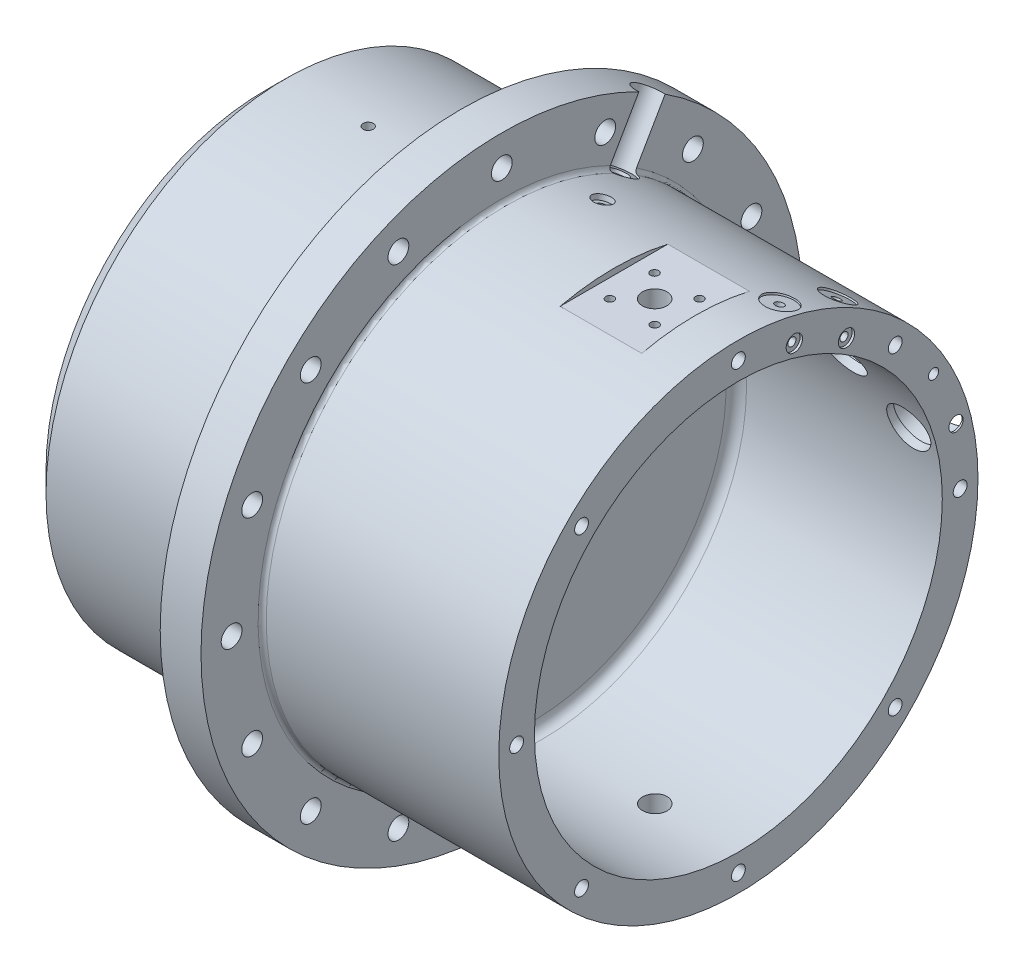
from build123d import *

# Parameters (mm, degrees)
FASE1_SIZE                            = 2
KREISMUSTER1_COUNT                    = 8
FASE2_SIZE                            = 10
SKIZZE4_W                             = 100
SKIZZE4_H                             = 40
SCHNITT_LINEAR_AUSTRAGEN1_DEPTH       = 3
M5_GEWINDEBOHRUNG1_AT_2_COUNT         = 2
M5_GEWINDEBOHRUNG1_AT_2_PITCH         = 22
M5_GEWINDEBOHRUNG1_AT_3_COUNT         = 2
M5_GEWINDEBOHRUNG1_AT_3_PITCH         = 31.08799153
M5_GEWINDEBOHRUNG1_AT_4_COUNT         = 2
M5_GEWINDEBOHRUNG1_AT_4_PITCH         = 22
F_12_0_12_DURCHMESSER_BOHRUNG1_REACH  = 358.217
F_12_0_12_DURCHMESSER_BOHRUNG1_BORE_R = 6
M12_GEWINDEKERNLOCH1_D                = 10.2
KREISMUSTER2_COUNT                    = 16
F_4_0_4_DURCHMESSER_BOHRUNG1_D        = 4
F_4_0_4_DURCHMESSER_BOHRUNG1_DEPTH    = 100
F_4_0_4_DURCHMESSER_BOHRUNG1_TIP      = 1.201721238
F_4_0_4_DURCHMESSER_BOHRUNG2_D        = 4
F_4_0_4_DURCHMESSER_BOHRUNG2_DEPTH    = 120
F_4_0_4_DURCHMESSER_BOHRUNG2_TIP      = 1.201721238
SKIZZE16_R                            = 4
SCHNITT_LINEAR_AUSTRAGEN3_DEPTH       = 1.2
SKIZZE17_R                            = 4.5
SCHNITT_LINEAR_AUSTRAGEN4_DEPTH       = 2.5
SKIZZE18_R                            = 4.5
SCHNITT_LINEAR_AUSTRAGEN5_DEPTH       = 2.5
SCHNITT_LINEAR_AUSTRAGEN11_DEPTH      = 359.762791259
SCHNITT_LINEAR_AUSTRAGEN11_DEPTH_BACK = 1
SKIZZE23_R                            = 7.5
M5_GEWINDEKERNLOCH3_D                 = 4.2
M5_GEWINDEKERNLOCH3_DEPTH             = 20
M5_GEWINDEKERNLOCH3_TIP               = 1.2618073
M5_GEWINDEKERNLOCH5_D                 = 4.2
M5_GEWINDEKERNLOCH5_DEPTH             = 22
M5_GEWINDEKERNLOCH5_TIP               = 1.2618073
SKIZZE27_R                            = 12.5
SCHNITT_LINEAR_AUSTRAGEN6_DEPTH       = 14
SCHNITT_LINEAR_AUSTRAGEN7_REACH       = 348.374
SCHNITT_LINEAR_AUSTRAGEN7_END_RADIUS  = 100
SKIZZE28_R                            = 10.5
M6_GEWINDEKERNLOCH1_REACH             = 394.525
M6_GEWINDEKERNLOCH1_BORE_R            = 2.5
SCHNITT_LINEAR_AUSTRAGEN8_REACH       = 355.445
SCHNITT_LINEAR_AUSTRAGEN8_END_RADIUS  = 100
SKIZZE32_R                            = 2.5
SCHNITT_LINEAR_AUSTRAGEN9_REACH       = 363.105
SCHNITT_LINEAR_AUSTRAGEN9_END_RADIUS  = 100
SKIZZE33_R                            = 10.5
SKIZZE34_R                            = 12.5
SCHNITT_LINEAR_AUSTRAGEN10_DEPTH      = 14
F_7_0_7_DURCHMESSER_BOHRUNG2_REACH    = 388.614
F_7_0_7_DURCHMESSER_BOHRUNG2_BORE_R   = 3.5
SKIZZE41_R                            = 7.5
SCHNITT_LINEAR_AUSTRAGEN12_DEPTH      = 1
SKIZZE42_R                            = 7.5
SCHNITT_LINEAR_AUSTRAGEN13_DEPTH      = 1
M5_GEWINDEKERNLOCH6_D                 = 4.2
M5_GEWINDEKERNLOCH6_DEPTH             = 12
M5_GEWINDEKERNLOCH6_TIP               = 1.2618073
M5_GEWINDEKERNLOCH6_ON_FACE_2_D       = 4.2
M5_GEWINDEKERNLOCH6_ON_FACE_2_DEPTH   = 12
M5_GEWINDEKERNLOCH6_ON_FACE_2_TIP     = 1.2618073


with BuildPart() as part:
    # Skizze1 → Rotation1 (revolve)
    with BuildSketch(Plane.XY, mode=Mode.PRIVATE) as rotation1_sk:
        with BuildLine():
            Line((-76.944736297, 117.5), (14.055263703, 117.5))
            ThreePointArc((14.055263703, 117.5), (17.590797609, 118.964466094), (19.055263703, 122.5))
            Line((19.055263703, 122.5), (19.055263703, 147.5))
            Line((19.055263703, 147.5), (39.055263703, 147.5))
            Line((39.055263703, 147.5), (39.055263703, 119.5))
            ThreePointArc((39.055263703, 119.5), (39.64105014, 118.085786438), (41.055263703, 117.5))
            Line((41.055263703, 117.5), (155.055263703, 117.5))
            Line((155.055263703, 117.5), (155.055263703, 100))
            Line((155.055263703, 100), (59.055263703, 100))
            ThreePointArc((59.055263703, 100), (55.519729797, 98.535533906), (54.055263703, 95))
            Line((54.055263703, 95), (54.055263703, 40.5))
            Line((54.055263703, 40.5), (49.555263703, 40.5))
            Line((49.555263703, 40.5), (49.555263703, 44.902710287))
            Line((49.555263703, 44.902710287), (43.555263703, 44.902710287))
            Line((43.555263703, 44.902710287), (43.555263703, 40.5))
            Line((43.555263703, 40.5), (39.055263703, 40.5))
            Line((39.055263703, 40.5), (39.055263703, 95))
            ThreePointArc((39.055263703, 95), (37.590797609, 98.535533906), (34.055263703, 100))
            Line((34.055263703, 100), (-76.944736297, 100))
            Line((-76.944736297, 100), (-76.944736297, 117.5))
        make_face()
    revolve(rotation1_sk.sketch.rotate(Axis((0, 0, 0), (1, 0, 0)), 90), axis=Axis((0, 0, 0), (1, 0, 0)))

    # Fase1
    fase1_edges = [part.edges().sort_by_distance(p)[0] for p in [
        (54.055263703, 0, -40.5),
        (39.055263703, 0, -40.5),
    ]]
    chamfer(fase1_edges, length=FASE1_SIZE)

    # Skizze3 → M8 Gewindekernloch1 (revolve, cut)
    with BuildSketch(Plane(origin=(155.055263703, 108.75, 0), x_dir=(0, 0, -1), z_dir=(0, 1, 0))):
        Polygon((0, 0), (0, 24.292926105), (3.4, 22.25), (3.4, 0), align=None)
    m8_gewindekernloch1 = revolve(axis=Axis((161.405263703, 108.75, 0), (-1, 0, 0)), mode=Mode.SUBTRACT)

    # Kreismuster1: M8 Gewindekernloch1 ×8 about axis
    kreismuster1_axis = Axis((0, 0, 0), (1, 0, 0))
    for i in range(1, KREISMUSTER1_COUNT):
        add(m8_gewindekernloch1.rotate(kreismuster1_axis, i * 360 / KREISMUSTER1_COUNT), mode=Mode.SUBTRACT)

    # Fase2
    fase2_edges = [part.edges().sort_by_distance(p)[0] for p in [
        (-76.944736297, 0, -117.5),
    ]]
    chamfer(fase2_edges, length=FASE2_SIZE)

    # Skizze4 → Schnitt-Linear austragen1 (cut)
    with BuildSketch(Plane(origin=(-26.444736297, 117.5, 0), x_dir=(0, 0, -1), z_dir=(0, 1, 0))):
        with Locations((0, -140.5)):
            Rectangle(SKIZZE4_W, SKIZZE4_H)
    schnitt_linear_austragen1 = extrude(amount=-SCHNITT_LINEAR_AUSTRAGEN1_DEPTH, mode=Mode.SUBTRACT)

    # Spiegeln1: Schnitt-Linear austragen1 across plane
    add(schnitt_linear_austragen1.mirror(Plane.ZX), mode=Mode.SUBTRACT)

    # Skizze7 → M5 Gewindebohrung1 (revolve, cut)
    with BuildSketch(Plane(origin=(125.020336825, 114.5, -10.985670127), x_dir=(0, 0, 1), z_dir=(1, 0, 0))):
        Polygon((0, 0), (0, 13.201721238), (2, 12), (2, 0), align=None)
    m5_gewindebohrung1 = revolve(axis=Axis((125.020336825, 120.85, -10.985670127), (0, -1, 0)), mode=Mode.SUBTRACT)

    # M5 Gewindebohrung1 at 2: M5 Gewindebohrung1 ×2
    with Locations(*[Vector(0.0015875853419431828, 0, 0.9999987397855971) * (i * M5_GEWINDEBOHRUNG1_AT_2_PITCH) for i in range(1, M5_GEWINDEBOHRUNG1_AT_2_COUNT)]):
        add(m5_gewindebohrung1, mode=Mode.SUBTRACT)

    # M5 Gewindebohrung1 at 3: M5 Gewindebohrung1 ×2
    with Locations(*[Vector(-0.7065452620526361, 0, 0.7076678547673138) * (i * M5_GEWINDEBOHRUNG1_AT_3_PITCH) for i in range(1, M5_GEWINDEBOHRUNG1_AT_3_COUNT)]):
        add(m5_gewindebohrung1, mode=Mode.SUBTRACT)

    # M5 Gewindebohrung1 at 4: M5 Gewindebohrung1 ×2
    with Locations(*[Vector(-0.9999949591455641, 0, 0.0031751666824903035) * (i * M5_GEWINDEBOHRUNG1_AT_4_PITCH) for i in range(1, M5_GEWINDEBOHRUNG1_AT_4_COUNT)]):
        add(m5_gewindebohrung1, mode=Mode.SUBTRACT)

    # 12.0 _12 _ Durchmesser Bohrung1 bore (on position points) → 12.0 _12 _ Durchmesser Bohrung1 (cut, up to next)
    with BuildSketch(Plane(origin=(114.055263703, 114.5, 0.031751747), x_dir=(0, 0, 1), z_dir=(0, 1, 0)), mode=Mode.PRIVATE) as f_12_0_12_durchmesser_bohrung1_sk1:
        Circle(F_12_0_12_DURCHMESSER_BOHRUNG1_BORE_R)
    f_12_0_12_durchmesser_bohrung1_tool1 = extrude(f_12_0_12_durchmesser_bohrung1_sk1.sketch, amount=-F_12_0_12_DURCHMESSER_BOHRUNG1_REACH, mode=Mode.PRIVATE) & part.part
    f_12_0_12_durchmesser_bohrung1 = f_12_0_12_durchmesser_bohrung1_tool1.solids().sort_by_distance((114.055264, 114.5, 0.031752))[0]
    add(f_12_0_12_durchmesser_bohrung1, mode=Mode.SUBTRACT)

    # Spiegeln2: M5 Gewindebohrung1, 12.0 _12 _ Durchmesser Bohrung1 across plane
    add(m5_gewindebohrung1.mirror(Plane.ZX), mode=Mode.SUBTRACT)
    add(f_12_0_12_durchmesser_bohrung1.mirror(Plane.ZX), mode=Mode.SUBTRACT)

    # Spiegeln2 copy 1 sketch → Spiegeln2 copy 1 (revolve, cut)
    with BuildSketch(Plane(origin=(125.055263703, -114.5, 11.014302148), x_dir=(0, 0, 1), z_dir=(1, 0, 0))):
        Polygon((0, 0), (0, -13.201721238), (2, -12), (2, 0), align=None)
    revolve(axis=Axis((125.055263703, -120.85, 11.014302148), (0, -1, 0)), mode=Mode.SUBTRACT)

    # Spiegeln2 copy 2 sketch → Spiegeln2 copy 2 (revolve, cut)
    with BuildSketch(Plane(origin=(103.055263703, -114.5, 11.014302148), x_dir=(0, 0, 1), z_dir=(1, 0, 0))):
        Polygon((0, 0), (0, -13.201721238), (2, -12), (2, 0), align=None)
    revolve(axis=Axis((103.055263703, -120.85, 11.014302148), (0, -1, 0)), mode=Mode.SUBTRACT)

    # Spiegeln2 copy 3 sketch → Spiegeln2 copy 3 (revolve, cut)
    with BuildSketch(Plane(origin=(103.020447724, -114.5, -10.91581646), x_dir=(0, 0, 1), z_dir=(1, 0, 0))):
        Polygon((0, 0), (0, -13.201721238), (2, -12), (2, 0), align=None)
    revolve(axis=Axis((103.020447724, -120.85, -10.91581646), (0, -1, 0)), mode=Mode.SUBTRACT)

    # M12 Gewindekernloch1 (through all)
    with Locations(Plane(origin=(39.055263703, 132.5, 0), x_dir=(0, 0, 1), z_dir=(1, 0, 0))):
        with Locations((0, 0)):
            m12_gewindekernloch1 = Hole(M12_GEWINDEKERNLOCH1_D / 2)

    # Kreismuster2: M12 Gewindekernloch1 ×16 about axis
    kreismuster2_axis = Axis((0, 0, 0), (1, 0, 0))
    for i in range(1, KREISMUSTER2_COUNT):
        add(m12_gewindekernloch1.rotate(kreismuster2_axis, i * 360 / KREISMUSTER2_COUNT), mode=Mode.SUBTRACT)

    # 4.0 _4 _ Durchmesser Bohrung1
    with Locations(Plane(origin=(155.055263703, 102.388137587, -27.434818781), x_dir=(0, 0, 1), z_dir=(1, 0, 0))):
        with Locations((0, 0)):
            Hole(F_4_0_4_DURCHMESSER_BOHRUNG1_D / 2, depth=F_4_0_4_DURCHMESSER_BOHRUNG1_DEPTH)
            with Locations((0, 0, -(F_4_0_4_DURCHMESSER_BOHRUNG1_DEPTH + F_4_0_4_DURCHMESSER_BOHRUNG1_TIP / 2))):  # 118° drill point
                Cone(0, F_4_0_4_DURCHMESSER_BOHRUNG1_D / 2, F_4_0_4_DURCHMESSER_BOHRUNG1_TIP, mode=Mode.SUBTRACT)

    # 4.0 _4 _ Durchmesser Bohrung2
    with Locations(Plane(origin=(155.055263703, 91.798692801, -53), x_dir=(0, 0, 1), z_dir=(1, 0, 0))):
        with Locations((0, 0)):
            Hole(F_4_0_4_DURCHMESSER_BOHRUNG2_D / 2, depth=F_4_0_4_DURCHMESSER_BOHRUNG2_DEPTH)
            with Locations((0, 0, -(F_4_0_4_DURCHMESSER_BOHRUNG2_DEPTH + F_4_0_4_DURCHMESSER_BOHRUNG2_TIP / 2))):  # 118° drill point
                Cone(0, F_4_0_4_DURCHMESSER_BOHRUNG2_D / 2, F_4_0_4_DURCHMESSER_BOHRUNG2_TIP, mode=Mode.SUBTRACT)

    # Skizze16 → Schnitt-Linear austragen3 (cut)
    with BuildSketch(Plane(origin=(155.055263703, 0, 0), x_dir=(0, 0, -1), z_dir=(1, 0, 0))):
        with Locations((27.434818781, 102.388137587)):
            Circle(SKIZZE16_R)
        with Locations((53, 91.798692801)):
            Circle(SKIZZE16_R)
    extrude(amount=-SCHNITT_LINEAR_AUSTRAGEN3_DEPTH, mode=Mode.SUBTRACT)

    # Skizze17 → Schnitt-Linear austragen4 (cut)
    with BuildSketch(Plane(origin=(98.055263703, 113.496284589, -30.4112378), x_dir=(0, -0.25881904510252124, -0.9659258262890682), z_dir=(0, 0.9659258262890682, -0.25881904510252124))):
        with Locations(Location((0, 40, 0), (0, 0, 180))):
            Circle(SKIZZE17_R)
    extrude(amount=-SCHNITT_LINEAR_AUSTRAGEN4_DEPTH, mode=Mode.SUBTRACT)

    # Skizze18 → Schnitt-Linear austragen5 (cut)
    with BuildSketch(Plane(origin=(98.055263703, 101.757984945, -58.75), x_dir=(0, -0.500000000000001, -0.866025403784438), z_dir=(0, 0.866025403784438, -0.500000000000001))):
        with Locations(Location((0, 60, 0), (0, 0, 180))):
            Circle(SKIZZE18_R)
    extrude(amount=-SCHNITT_LINEAR_AUSTRAGEN5_DEPTH, mode=Mode.SUBTRACT)

    # Skizze23 → Schnitt-Linear austragen11 (cut, two sides: drawn at the far end of the back side and taken through both)
    with BuildSketch(Plane(origin=(0, 101.757984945, -58.75), x_dir=(-1, 0, 0), z_dir=(0, 0.866025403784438, -0.500000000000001)).offset(-SCHNITT_LINEAR_AUSTRAGEN11_DEPTH_BACK)):
        with Locations(Location((-38.055263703, 0, 0), (0, 0, 262.337744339))):
            Circle(SKIZZE23_R)
    extrude(amount=SCHNITT_LINEAR_AUSTRAGEN11_DEPTH + SCHNITT_LINEAR_AUSTRAGEN11_DEPTH_BACK, mode=Mode.SUBTRACT)

    # M5 Gewindekernloch3
    with Locations(Plane(origin=(38.055263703, 100.891959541, -58.25), x_dir=(0, 0.5, 0.866025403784), z_dir=(0, 0.866025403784, -0.5))):
        with Locations((0, 0)):
            Hole(M5_GEWINDEKERNLOCH3_D / 2, depth=M5_GEWINDEKERNLOCH3_DEPTH)
            with Locations((0, 0, -(M5_GEWINDEKERNLOCH3_DEPTH + M5_GEWINDEKERNLOCH3_TIP / 2))):  # 118° drill point
                Cone(0, M5_GEWINDEKERNLOCH3_D / 2, M5_GEWINDEKERNLOCH3_TIP, mode=Mode.SUBTRACT)

    # M5 Gewindekernloch5
    with Locations(Plane(origin=(58.055263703, 111.081470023, -29.764190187), x_dir=(0, 0.258819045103, 0.965925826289), z_dir=(0, 0.965925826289, -0.258819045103))):
        with Locations((0, 0)):
            Hole(M5_GEWINDEKERNLOCH5_D / 2, depth=M5_GEWINDEKERNLOCH5_DEPTH)
            with Locations((0, 0, -(M5_GEWINDEKERNLOCH5_DEPTH + M5_GEWINDEKERNLOCH5_TIP / 2))):  # 118° drill point
                Cone(0, M5_GEWINDEKERNLOCH5_D / 2, M5_GEWINDEKERNLOCH5_TIP, mode=Mode.SUBTRACT)

    # Skizze27 → Schnitt-Linear austragen6 (cut)
    with BuildSketch(Plane(origin=(98.055263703, 58.75, -101.757984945), x_dir=(0, -0.8660254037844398, -0.49999999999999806), z_dir=(0, 0.49999999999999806, -0.8660254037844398))):
        with Locations(Location((0, -22, 0), (0, 0, 180))):
            Circle(SKIZZE27_R)
    extrude(amount=-SCHNITT_LINEAR_AUSTRAGEN6_DEPTH, mode=Mode.SUBTRACT)

    # Schnitt-Linear austragen7: up to this cylinder (the profile starts outside it)
    schnitt_linear_austragen7_end = Plane(origin=(120.055264, 0, 0), z_dir=(-1, 0, 0)) * Cylinder(SCHNITT_LINEAR_AUSTRAGEN7_END_RADIUS, 897.748, mode=Mode.PRIVATE)
    # Skizze28 → Schnitt-Linear austragen7 (cut, up to the surface)
    with BuildSketch(Plane(origin=(0, 51.75, -89.633629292), x_dir=(-1, 0, 0), z_dir=(0, 0.49999999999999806, -0.8660254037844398)), mode=Mode.PRIVATE) as schnitt_linear_austragen7_sk1:
        with Locations(Location((-120.055263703, 0, 0), (0, 0, 90))):
            Circle(SKIZZE28_R)
    schnitt_linear_austragen7_tool1 = extrude(schnitt_linear_austragen7_sk1.sketch, amount=-SCHNITT_LINEAR_AUSTRAGEN7_REACH, mode=Mode.PRIVATE) - schnitt_linear_austragen7_end
    add(schnitt_linear_austragen7_tool1.solids().sort_by_distance((120.055264, 51.75, -89.633629))[0], mode=Mode.SUBTRACT)

    # M6 Gewindekernloch1 bore (on position points) → M6 Gewindekernloch1 (cut, up to next)
    with BuildSketch(Plane(origin=(155.055263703, 55.25, -95.695807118), x_dir=(0, 0, 1), z_dir=(1, 0, 0)), mode=Mode.PRIVATE) as m6_gewindekernloch1_sk1:
        Circle(M6_GEWINDEKERNLOCH1_BORE_R)
    m6_gewindekernloch1_tool1 = extrude(m6_gewindekernloch1_sk1.sketch, amount=-M6_GEWINDEKERNLOCH1_REACH, mode=Mode.PRIVATE) & part.part
    add(m6_gewindekernloch1_tool1.solids().sort_by_distance((155.055264, 55.25, -95.695807))[0], mode=Mode.SUBTRACT)

    # Schnitt-Linear austragen8: up to this cylinder (the profile starts outside it)
    schnitt_linear_austragen8_end = Plane(origin=(-26.444736, 0, 0), z_dir=(-1, 0, 0)) * Cylinder(SCHNITT_LINEAR_AUSTRAGEN8_END_RADIUS, 911.89, mode=Mode.PRIVATE)
    # Skizze32 → Schnitt-Linear austragen8 (cut, up to the surface)
    with BuildSketch(Plane(origin=(-26.444736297, 117.5, 0), x_dir=(0, 0, -1), z_dir=(0, 1, 0)), mode=Mode.PRIVATE) as schnitt_linear_austragen8_sk1:
        with Locations(Location((0, 0, 0), (0, 0, 180))):
            Circle(SKIZZE32_R)
    schnitt_linear_austragen8_tool1 = extrude(schnitt_linear_austragen8_sk1.sketch, amount=-SCHNITT_LINEAR_AUSTRAGEN8_REACH, mode=Mode.PRIVATE) - schnitt_linear_austragen8_end
    add(schnitt_linear_austragen8_tool1.solids().sort_by_distance((-26.444736, 117.5, 0))[0], mode=Mode.SUBTRACT)

    # Schnitt-Linear austragen9: up to this cylinder (the profile starts outside it)
    schnitt_linear_austragen9_end = Plane(origin=(142.055264, 0, 0), z_dir=(-1, 0, 0)) * Cylinder(SCHNITT_LINEAR_AUSTRAGEN9_END_RADIUS, 927.21, mode=Mode.PRIVATE)
    # Skizze33 → Schnitt-Linear austragen9 (cut, up to the surface)
    with BuildSketch(Plane(origin=(98.055263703, 30.4112378, -113.496284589), x_dir=(0, -0.9659258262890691, -0.2588190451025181), z_dir=(0, 0.258819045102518, -0.965925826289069)), mode=Mode.PRIVATE) as schnitt_linear_austragen9_sk1:
        with Locations(Location((0, -44, 0), (0, 0, 180))):
            Circle(SKIZZE33_R)
    schnitt_linear_austragen9_tool1 = extrude(schnitt_linear_austragen9_sk1.sketch, amount=-SCHNITT_LINEAR_AUSTRAGEN9_REACH, mode=Mode.PRIVATE) - schnitt_linear_austragen9_end
    add(schnitt_linear_austragen9_tool1.solids().sort_by_distance((142.055264, 30.411238, -113.496285))[0], mode=Mode.SUBTRACT)

    # Skizze34 → Schnitt-Linear austragen10 (cut)
    with BuildSketch(Plane(origin=(98.055263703, 30.4112378, -113.496284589), x_dir=(0, -0.9659258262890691, -0.2588190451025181), z_dir=(0, 0.258819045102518, -0.965925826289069))):
        with Locations(Location((0, -44, 0), (0, 0, 180))):
            Circle(SKIZZE34_R)
    extrude(amount=-SCHNITT_LINEAR_AUSTRAGEN10_DEPTH, mode=Mode.SUBTRACT)

    # 7.0 _7 _ Durchmesser Bohrung2 bore (on position points) → 7.0 _7 _ Durchmesser Bohrung2 (cut, up to next)
    with BuildSketch(Plane(origin=(155.055263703, 28.599504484, -106.734803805), x_dir=(0, 0, 1), z_dir=(1, 0, 0)), mode=Mode.PRIVATE) as f_7_0_7_durchmesser_bohrung2_sk1:
        Circle(F_7_0_7_DURCHMESSER_BOHRUNG2_BORE_R)
    f_7_0_7_durchmesser_bohrung2_tool1 = extrude(f_7_0_7_durchmesser_bohrung2_sk1.sketch, amount=-F_7_0_7_DURCHMESSER_BOHRUNG2_REACH, mode=Mode.PRIVATE) & part.part
    add(f_7_0_7_durchmesser_bohrung2_tool1.solids().sort_by_distance((155.055264, 28.599504, -106.734804))[0], mode=Mode.SUBTRACT)

    # Skizze41 → Schnitt-Linear austragen12 (cut)
    with BuildSketch(Plane(origin=(98.055263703, 113.496284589, -30.4112378), x_dir=(0, -0.25881904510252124, -0.9659258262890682), z_dir=(0, 0.9659258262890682, -0.25881904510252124))):
        with Locations(Location((0, -47, 0), (0, 0, 180))):
            Circle(SKIZZE41_R)
    extrude(amount=-SCHNITT_LINEAR_AUSTRAGEN12_DEPTH, mode=Mode.SUBTRACT)

    # Skizze42 → Schnitt-Linear austragen13 (cut)
    with BuildSketch(Plane(origin=(98.055263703, 101.757984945, -58.75), x_dir=(0, -0.500000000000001, -0.866025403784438), z_dir=(0, 0.866025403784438, -0.500000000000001))):
        with Locations(Location((0, -47, 0), (0, 0, 180))):
            Circle(SKIZZE42_R)
    extrude(amount=-SCHNITT_LINEAR_AUSTRAGEN13_DEPTH, mode=Mode.SUBTRACT)

    # M5 Gewindekernloch6
    with Locations(Plane(origin=(145.055263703, 100.891959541, -58.25), x_dir=(0, 0.5, 0.866025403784), z_dir=(0, 0.866025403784, -0.5))):
        with Locations((0, 0)):
            Hole(M5_GEWINDEKERNLOCH6_D / 2, depth=M5_GEWINDEKERNLOCH6_DEPTH)
            with Locations((0, 0, -(M5_GEWINDEKERNLOCH6_DEPTH + M5_GEWINDEKERNLOCH6_TIP / 2))):  # 118° drill point
                Cone(0, M5_GEWINDEKERNLOCH6_D / 2, M5_GEWINDEKERNLOCH6_TIP, mode=Mode.SUBTRACT)

    # M5 Gewindekernloch6 on face 2
    with Locations(Plane(origin=(145.055263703, 112.530358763, -30.152418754), x_dir=(0, 0.258818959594, 0.965925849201), z_dir=(0, 0.965925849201, -0.258818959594))):
        with Locations((-1e-09, 0)):
            Hole(M5_GEWINDEKERNLOCH6_ON_FACE_2_D / 2, depth=M5_GEWINDEKERNLOCH6_ON_FACE_2_DEPTH)
            with Locations((0, 0, -(M5_GEWINDEKERNLOCH6_ON_FACE_2_DEPTH + M5_GEWINDEKERNLOCH6_ON_FACE_2_TIP / 2))):  # 118° drill point
                Cone(0, M5_GEWINDEKERNLOCH6_ON_FACE_2_D / 2, M5_GEWINDEKERNLOCH6_ON_FACE_2_TIP, mode=Mode.SUBTRACT)


solid = part.part
